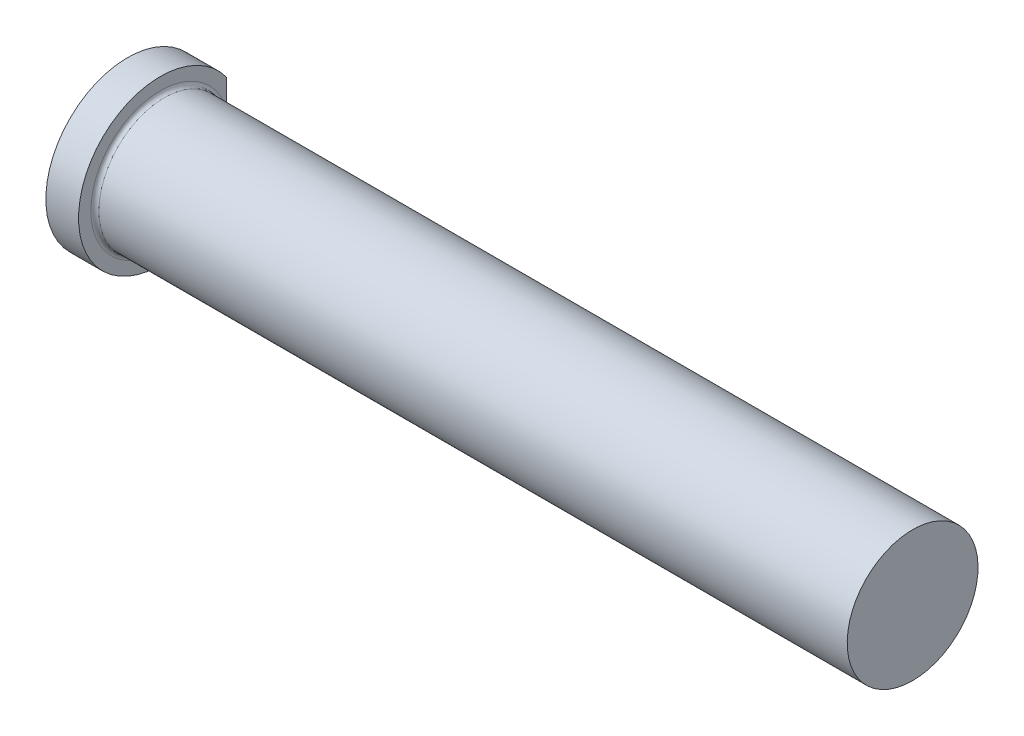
from build123d import *


with BuildPart() as part:
    # Sketch1 → PIN (revolve)
    with BuildSketch(Plane.XY, mode=Mode.PRIVATE) as pin_sk:
        with BuildLine():
            Line((0, 0), (0, 15.875))
            Line((0, 15.875), (6.35, 15.875))
            Line((6.35, 15.875), (6.35, 13.4874))
            ThreePointArc((6.35, 13.4874), (6.58062412, 12.93062412), (7.1374, 12.7))
            Line((7.1374, 12.7), (152.4, 12.7))
            Line((152.4, 12.7), (152.4, 0))
            Line((152.4, 0), (0, 0))
        make_face()
    revolve(pin_sk.sketch.rotate(Axis((152.4, 0, 0), (-1, 0, 0)), 180), axis=Axis((152.4, 0, 0), (-1, 0, 0)))

    # SurfaceCut1
    split(bisect_by=Plane(origin=(0, 0, -12.8778), x_dir=(-1, 0, 0), z_dir=(0, 0, -1)), keep=Keep.BOTTOM)


solid = part.part
